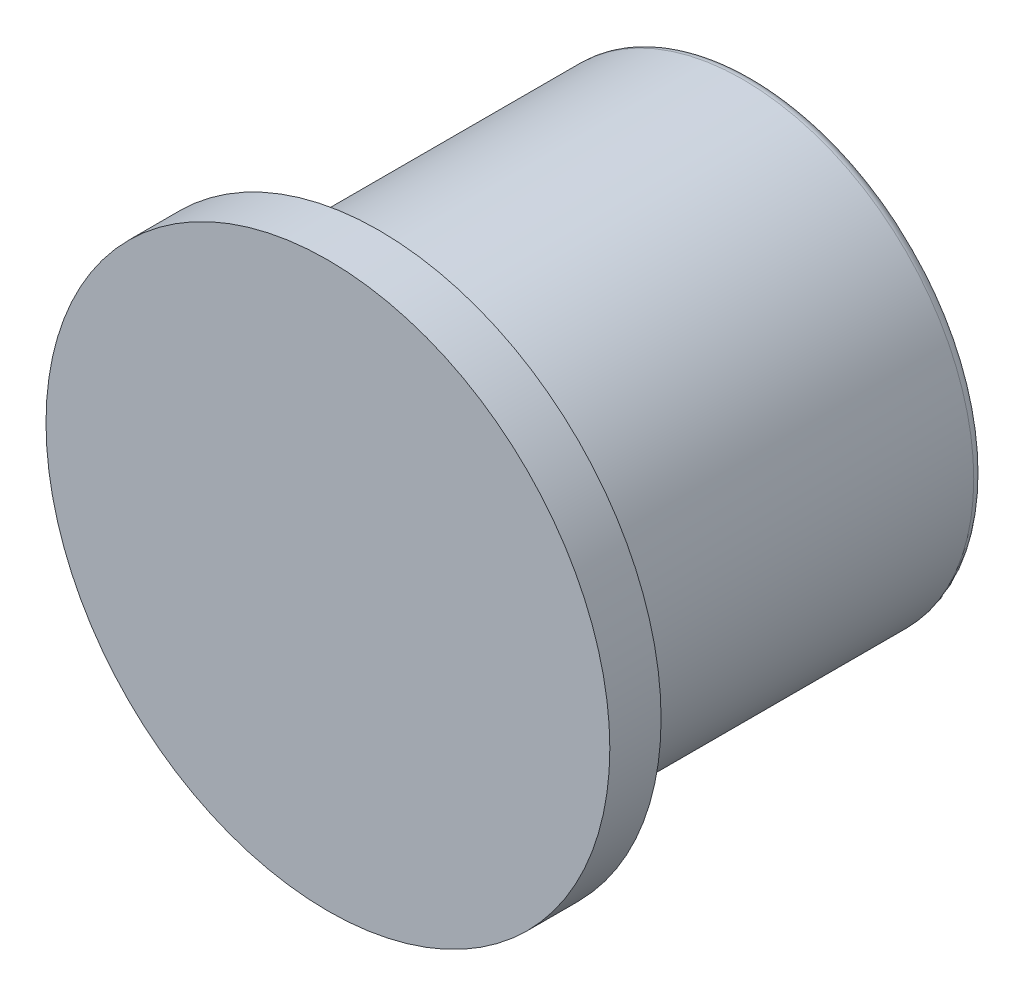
ISO-10303-21;
HEADER;
FILE_DESCRIPTION(('STEP AP214'),'2;1');
FILE_NAME('part.step','',(''),(''),'','','');
FILE_SCHEMA(('AUTOMOTIVE_DESIGN { 1 0 10303 214 1 1 1 1 }'));
ENDSEC;
DATA;
#1=APPLICATION_CONTEXT('core data for automotive mechanical design processes');
#2=APPLICATION_PROTOCOL_DEFINITION('international standard','automotive_design',2000,#1);
#3=PRODUCT_CONTEXT('',#1,'mechanical');
#4=PRODUCT('Part','Part','',(#3));
#5=PRODUCT_RELATED_PRODUCT_CATEGORY('part','',(#4));
#6=PRODUCT_DEFINITION_FORMATION('','',#4);
#7=PRODUCT_DEFINITION_CONTEXT('part definition',#1,'design');
#8=PRODUCT_DEFINITION('design','',#6,#7);
#9=PRODUCT_DEFINITION_SHAPE('','',#8);
#10=(LENGTH_UNIT() NAMED_UNIT(*) SI_UNIT(.MILLI.,.METRE.));
#11=(NAMED_UNIT(*) PLANE_ANGLE_UNIT() SI_UNIT($,.RADIAN.));
#12=(NAMED_UNIT(*) SI_UNIT($,.STERADIAN.) SOLID_ANGLE_UNIT());
#13=UNCERTAINTY_MEASURE_WITH_UNIT(LENGTH_MEASURE(1.E-05),#10,'distance_accuracy_value','');
#14=(GEOMETRIC_REPRESENTATION_CONTEXT(3) GLOBAL_UNCERTAINTY_ASSIGNED_CONTEXT((#13)) GLOBAL_UNIT_ASSIGNED_CONTEXT((#10,
#11,#12)) REPRESENTATION_CONTEXT('',''));
#15=CARTESIAN_POINT('',(0.,0.,0.));
#16=DIRECTION('',(0.,0.,1.));
#17=DIRECTION('',(1.,0.,0.));
#18=AXIS2_PLACEMENT_3D('',#15,#16,#17);
#19=CARTESIAN_POINT('',(0.,0.,-83.));
#20=DIRECTION('',(0.,0.,1.));
#21=DIRECTION('',(1.,0.,0.));
#22=AXIS2_PLACEMENT_3D('',#19,#20,#21);
#23=PLANE('',#22);
#24=CARTESIAN_POINT('',(0.,0.,-83.));
#25=DIRECTION('',(0.,0.,-1.));
#26=DIRECTION('',(-1.,0.,0.));
#27=AXIS2_PLACEMENT_3D('',#24,#25,#26);
#28=CIRCLE('',#27,4.5);
#29=CARTESIAN_POINT('',(-4.5,0.,-83.));
#30=VERTEX_POINT('',#29);
#31=EDGE_CURVE('E58',#30,#30,#28,.T.);
#32=ORIENTED_EDGE('',*,*,#31,.F.);
#33=EDGE_LOOP('',(#32));
#34=FACE_BOUND('',#33,.T.);
#35=CARTESIAN_POINT('',(0.,0.,-83.));
#36=DIRECTION('',(0.,0.,1.));
#37=DIRECTION('',(1.,0.,0.));
#38=AXIS2_PLACEMENT_3D('',#35,#36,#37);
#39=CIRCLE('',#38,43.);
#40=CARTESIAN_POINT('',(43.,0.,-83.));
#41=VERTEX_POINT('',#40);
#42=EDGE_CURVE('E11',#41,#41,#39,.T.);
#43=ORIENTED_EDGE('',*,*,#42,.F.);
#44=EDGE_LOOP('',(#43));
#45=FACE_BOUND('',#44,.T.);
#46=ADVANCED_FACE('F32',(#34,#45),#23,.F.);
#47=CARTESIAN_POINT('',(0.,0.,-81.));
#48=DIRECTION('',(0.,0.,1.));
#49=DIRECTION('',(1.,0.,0.));
#50=AXIS2_PLACEMENT_3D('',#47,#48,#49);
#51=TOROIDAL_SURFACE('',#50,43.,2.);
#52=CARTESIAN_POINT('',(0.,0.,-81.));
#53=DIRECTION('',(0.,0.,1.));
#54=DIRECTION('',(1.,0.,0.));
#55=AXIS2_PLACEMENT_3D('',#52,#53,#54);
#56=CIRCLE('',#55,45.);
#57=CARTESIAN_POINT('',(45.,0.,-81.));
#58=VERTEX_POINT('',#57);
#59=EDGE_CURVE('E38',#58,#58,#56,.T.);
#60=ORIENTED_EDGE('',*,*,#59,.F.);
#61=EDGE_LOOP('',(#60));
#62=FACE_BOUND('',#61,.T.);
#63=ORIENTED_EDGE('',*,*,#42,.T.);
#64=EDGE_LOOP('',(#63));
#65=FACE_BOUND('',#64,.T.);
#66=ADVANCED_FACE('F71',(#62,#65),#51,.T.);
#67=CARTESIAN_POINT('',(0.,0.,0.));
#68=DIRECTION('',(0.,0.,1.));
#69=DIRECTION('',(1.,0.,0.));
#70=AXIS2_PLACEMENT_3D('',#67,#68,#69);
#71=CYLINDRICAL_SURFACE('',#70,45.);
#72=CARTESIAN_POINT('',(0.,0.,-10.));
#73=DIRECTION('',(0.,0.,1.));
#74=DIRECTION('',(1.,0.,0.));
#75=AXIS2_PLACEMENT_3D('',#72,#73,#74);
#76=CIRCLE('',#75,45.);
#77=CARTESIAN_POINT('',(45.,0.,-10.));
#78=VERTEX_POINT('',#77);
#79=EDGE_CURVE('E64',#78,#78,#76,.T.);
#80=ORIENTED_EDGE('',*,*,#79,.F.);
#81=EDGE_LOOP('',(#80));
#82=FACE_BOUND('',#81,.T.);
#83=ORIENTED_EDGE('',*,*,#59,.T.);
#84=EDGE_LOOP('',(#83));
#85=FACE_BOUND('',#84,.T.);
#86=ADVANCED_FACE('F69',(#82,#85),#71,.T.);
#87=CARTESIAN_POINT('',(0.,45.,-10.));
#88=DIRECTION('',(0.,0.,1.));
#89=DIRECTION('',(1.,0.,0.));
#90=AXIS2_PLACEMENT_3D('',#87,#88,#89);
#91=PLANE('',#90);
#92=CARTESIAN_POINT('',(0.,0.,-10.));
#93=DIRECTION('',(0.,0.,1.));
#94=DIRECTION('',(1.,0.,0.));
#95=AXIS2_PLACEMENT_3D('',#92,#93,#94);
#96=CIRCLE('',#95,55.);
#97=CARTESIAN_POINT('',(55.,0.,-10.));
#98=VERTEX_POINT('',#97);
#99=EDGE_CURVE('E55',#98,#98,#96,.T.);
#100=ORIENTED_EDGE('',*,*,#99,.F.);
#101=EDGE_LOOP('',(#100));
#102=FACE_BOUND('',#101,.T.);
#103=ORIENTED_EDGE('',*,*,#79,.T.);
#104=EDGE_LOOP('',(#103));
#105=FACE_BOUND('',#104,.T.);
#106=ADVANCED_FACE('F99',(#102,#105),#91,.F.);
#107=CARTESIAN_POINT('',(0.,0.,0.));
#108=DIRECTION('',(0.,0.,1.));
#109=DIRECTION('',(1.,0.,0.));
#110=AXIS2_PLACEMENT_3D('',#107,#108,#109);
#111=CYLINDRICAL_SURFACE('',#110,55.);
#112=CARTESIAN_POINT('',(0.,0.,0.));
#113=DIRECTION('',(0.,0.,1.));
#114=DIRECTION('',(1.,0.,0.));
#115=AXIS2_PLACEMENT_3D('',#112,#113,#114);
#116=CIRCLE('',#115,55.);
#117=CARTESIAN_POINT('',(55.,0.,0.));
#118=VERTEX_POINT('',#117);
#119=EDGE_CURVE('E51',#118,#118,#116,.T.);
#120=ORIENTED_EDGE('',*,*,#119,.F.);
#121=EDGE_LOOP('',(#120));
#122=FACE_BOUND('',#121,.T.);
#123=ORIENTED_EDGE('',*,*,#99,.T.);
#124=EDGE_LOOP('',(#123));
#125=FACE_BOUND('',#124,.T.);
#126=ADVANCED_FACE('F95',(#122,#125),#111,.T.);
#127=CARTESIAN_POINT('',(0.,55.,0.));
#128=DIRECTION('',(0.,0.,-1.));
#129=DIRECTION('',(-1.,0.,0.));
#130=AXIS2_PLACEMENT_3D('',#127,#128,#129);
#131=PLANE('',#130);
#132=ORIENTED_EDGE('',*,*,#119,.T.);
#133=EDGE_LOOP('',(#132));
#134=FACE_BOUND('',#133,.T.);
#135=ADVANCED_FACE('F45',(#134),#131,.F.);
#136=CARTESIAN_POINT('',(0.,0.,-63.25));
#137=DIRECTION('',(0.,0.,-1.));
#138=DIRECTION('',(-1.,0.,0.));
#139=AXIS2_PLACEMENT_3D('',#136,#137,#138);
#140=CONICAL_SURFACE('',#139,3.39999999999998,1.02974425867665);
#141=CARTESIAN_POINT('',(0.,0.,-61.2070738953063));
#142=VERTEX_POINT('',#141);
#143=VERTEX_LOOP('',#142);
#144=FACE_BOUND('',#143,.T.);
#145=CARTESIAN_POINT('',(0.,0.,-63.25));
#146=DIRECTION('',(0.,0.,-1.));
#147=DIRECTION('',(-1.,0.,0.));
#148=AXIS2_PLACEMENT_3D('',#145,#146,#147);
#149=CIRCLE('',#148,3.39999999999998);
#150=CARTESIAN_POINT('',(-3.39999999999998,0.,-63.25));
#151=VERTEX_POINT('',#150);
#152=EDGE_CURVE('E49',#151,#151,#149,.T.);
#153=ORIENTED_EDGE('',*,*,#152,.T.);
#154=EDGE_LOOP('',(#153));
#155=FACE_BOUND('',#154,.T.);
#156=ADVANCED_FACE('F41',(#144,#155),#140,.F.);
#157=CARTESIAN_POINT('',(0.,0.,-83.));
#158=DIRECTION('',(0.,0.,-1.));
#159=DIRECTION('',(-1.,0.,0.));
#160=AXIS2_PLACEMENT_3D('',#157,#158,#159);
#161=CYLINDRICAL_SURFACE('',#160,3.39999999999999);
#162=ORIENTED_EDGE('',*,*,#152,.F.);
#163=EDGE_LOOP('',(#162));
#164=FACE_BOUND('',#163,.T.);
#165=CARTESIAN_POINT('',(0.,0.,-81.9));
#166=DIRECTION('',(0.,0.,-1.));
#167=DIRECTION('',(-1.,0.,0.));
#168=AXIS2_PLACEMENT_3D('',#165,#166,#167);
#169=CIRCLE('',#168,3.4);
#170=CARTESIAN_POINT('',(-3.4,0.,-81.9));
#171=VERTEX_POINT('',#170);
#172=EDGE_CURVE('E52',#171,#171,#169,.T.);
#173=ORIENTED_EDGE('',*,*,#172,.T.);
#174=EDGE_LOOP('',(#173));
#175=FACE_BOUND('',#174,.T.);
#176=ADVANCED_FACE('F44',(#164,#175),#161,.F.);
#177=CARTESIAN_POINT('',(0.,0.,-83.));
#178=DIRECTION('',(0.,0.,-1.));
#179=DIRECTION('',(-1.,0.,0.));
#180=AXIS2_PLACEMENT_3D('',#177,#178,#179);
#181=CONICAL_SURFACE('',#180,4.5,0.785398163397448);
#182=ORIENTED_EDGE('',*,*,#172,.F.);
#183=EDGE_LOOP('',(#182));
#184=FACE_BOUND('',#183,.T.);
#185=ORIENTED_EDGE('',*,*,#31,.T.);
#186=EDGE_LOOP('',(#185));
#187=FACE_BOUND('',#186,.T.);
#188=ADVANCED_FACE('F83',(#184,#187),#181,.F.);
#189=CLOSED_SHELL('',(#46,#66,#86,#106,#126,#135,#156,#176,#188));
#190=MANIFOLD_SOLID_BREP('B2',#189);
#191=ADVANCED_BREP_SHAPE_REPRESENTATION('',(#18,#190),#14);
#192=SHAPE_DEFINITION_REPRESENTATION(#9,#191);
ENDSEC;
END-ISO-10303-21;
